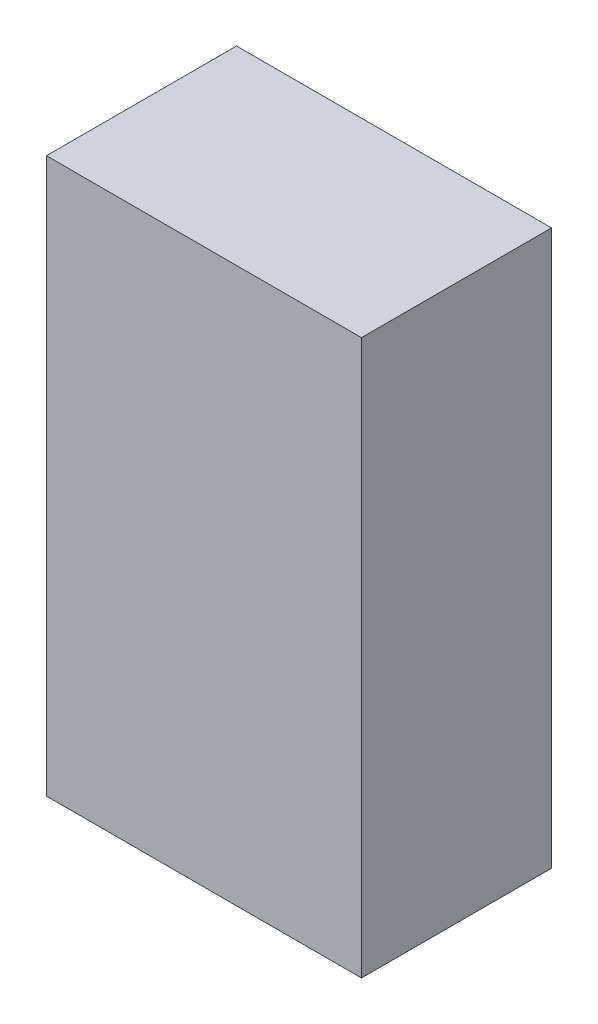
ISO-10303-21;
HEADER;
FILE_DESCRIPTION(('STEP AP214'),'2;1');
FILE_NAME('part.step','',(''),(''),'','','');
FILE_SCHEMA(('AUTOMOTIVE_DESIGN { 1 0 10303 214 1 1 1 1 }'));
ENDSEC;
DATA;
#1=APPLICATION_CONTEXT('core data for automotive mechanical design processes');
#2=APPLICATION_PROTOCOL_DEFINITION('international standard','automotive_design',2000,#1);
#3=PRODUCT_CONTEXT('',#1,'mechanical');
#4=PRODUCT('Part','Part','',(#3));
#5=PRODUCT_RELATED_PRODUCT_CATEGORY('part','',(#4));
#6=PRODUCT_DEFINITION_FORMATION('','',#4);
#7=PRODUCT_DEFINITION_CONTEXT('part definition',#1,'design');
#8=PRODUCT_DEFINITION('design','',#6,#7);
#9=PRODUCT_DEFINITION_SHAPE('','',#8);
#10=(LENGTH_UNIT() NAMED_UNIT(*) SI_UNIT(.MILLI.,.METRE.));
#11=(NAMED_UNIT(*) PLANE_ANGLE_UNIT() SI_UNIT($,.RADIAN.));
#12=(NAMED_UNIT(*) SI_UNIT($,.STERADIAN.) SOLID_ANGLE_UNIT());
#13=UNCERTAINTY_MEASURE_WITH_UNIT(LENGTH_MEASURE(1.E-05),#10,'distance_accuracy_value','');
#14=(GEOMETRIC_REPRESENTATION_CONTEXT(3) GLOBAL_UNCERTAINTY_ASSIGNED_CONTEXT((#13)) GLOBAL_UNIT_ASSIGNED_CONTEXT((#10,
#11,#12)) REPRESENTATION_CONTEXT('',''));
#15=CARTESIAN_POINT('',(0.,0.,0.));
#16=DIRECTION('',(0.,0.,1.));
#17=DIRECTION('',(1.,0.,0.));
#18=AXIS2_PLACEMENT_3D('',#15,#16,#17);
#19=CARTESIAN_POINT('',(-15.367,-27.051,18.542));
#20=DIRECTION('',(1.,0.,0.));
#21=DIRECTION('',(0.,0.,-1.));
#22=AXIS2_PLACEMENT_3D('',#19,#20,#21);
#23=PLANE('',#22);
#24=DIRECTION('',(0.,-1.,0.));
#25=VECTOR('',#24,1.);
#26=CARTESIAN_POINT('',(-15.367,-27.051,0.));
#27=LINE('',#26,#25);
#28=CARTESIAN_POINT('',(-15.367,27.051,0.));
#29=VERTEX_POINT('',#28);
#30=CARTESIAN_POINT('',(-15.367,-27.051,0.));
#31=VERTEX_POINT('',#30);
#32=EDGE_CURVE('E107',#29,#31,#27,.T.);
#33=ORIENTED_EDGE('',*,*,#32,.T.);
#34=DIRECTION('',(0.,0.,-1.));
#35=VECTOR('',#34,1.);
#36=CARTESIAN_POINT('',(-15.367,-27.051,18.542));
#37=LINE('',#36,#35);
#38=CARTESIAN_POINT('',(-15.367,-27.051,18.542));
#39=VERTEX_POINT('',#38);
#40=EDGE_CURVE('E11',#39,#31,#37,.T.);
#41=ORIENTED_EDGE('',*,*,#40,.F.);
#42=DIRECTION('',(0.,-1.,0.));
#43=VECTOR('',#42,1.);
#44=CARTESIAN_POINT('',(-15.367,-27.051,18.542));
#45=LINE('',#44,#43);
#46=CARTESIAN_POINT('',(-15.367,27.051,18.542));
#47=VERTEX_POINT('',#46);
#48=EDGE_CURVE('E91',#47,#39,#45,.T.);
#49=ORIENTED_EDGE('',*,*,#48,.F.);
#50=DIRECTION('',(0.,0.,-1.));
#51=VECTOR('',#50,1.);
#52=CARTESIAN_POINT('',(-15.367,27.051,18.542));
#53=LINE('',#52,#51);
#54=EDGE_CURVE('E103',#47,#29,#53,.T.);
#55=ORIENTED_EDGE('',*,*,#54,.T.);
#56=EDGE_LOOP('',(#33,#41,#49,#55));
#57=FACE_BOUND('',#56,.T.);
#58=ADVANCED_FACE('F38',(#57),#23,.F.);
#59=CARTESIAN_POINT('',(-15.367,-27.051,18.542));
#60=DIRECTION('',(0.,1.,0.));
#61=DIRECTION('',(0.,0.,1.));
#62=AXIS2_PLACEMENT_3D('',#59,#60,#61);
#63=PLANE('',#62);
#64=DIRECTION('',(1.,0.,0.));
#65=VECTOR('',#64,1.);
#66=CARTESIAN_POINT('',(-15.367,-27.051,0.));
#67=LINE('',#66,#65);
#68=CARTESIAN_POINT('',(15.367,-27.051,0.));
#69=VERTEX_POINT('',#68);
#70=EDGE_CURVE('E95',#31,#69,#67,.T.);
#71=ORIENTED_EDGE('',*,*,#70,.T.);
#72=DIRECTION('',(0.,0.,-1.));
#73=VECTOR('',#72,1.);
#74=CARTESIAN_POINT('',(15.367,-27.051,18.542));
#75=LINE('',#74,#73);
#76=CARTESIAN_POINT('',(15.367,-27.051,18.542));
#77=VERTEX_POINT('',#76);
#78=EDGE_CURVE('E46',#77,#69,#75,.T.);
#79=ORIENTED_EDGE('',*,*,#78,.F.);
#80=DIRECTION('',(1.,0.,0.));
#81=VECTOR('',#80,1.);
#82=CARTESIAN_POINT('',(-15.367,-27.051,18.542));
#83=LINE('',#82,#81);
#84=EDGE_CURVE('E86',#39,#77,#83,.T.);
#85=ORIENTED_EDGE('',*,*,#84,.F.);
#86=ORIENTED_EDGE('',*,*,#40,.T.);
#87=EDGE_LOOP('',(#71,#79,#85,#86));
#88=FACE_BOUND('',#87,.T.);
#89=ADVANCED_FACE('F94',(#88),#63,.F.);
#90=CARTESIAN_POINT('',(15.367,-27.051,18.542));
#91=DIRECTION('',(-1.,0.,0.));
#92=DIRECTION('',(0.,0.,1.));
#93=AXIS2_PLACEMENT_3D('',#90,#91,#92);
#94=PLANE('',#93);
#95=DIRECTION('',(0.,1.,0.));
#96=VECTOR('',#95,1.);
#97=CARTESIAN_POINT('',(15.367,-27.051,0.));
#98=LINE('',#97,#96);
#99=CARTESIAN_POINT('',(15.367,27.051,0.));
#100=VERTEX_POINT('',#99);
#101=EDGE_CURVE('E73',#69,#100,#98,.T.);
#102=ORIENTED_EDGE('',*,*,#101,.T.);
#103=DIRECTION('',(0.,0.,-1.));
#104=VECTOR('',#103,1.);
#105=CARTESIAN_POINT('',(15.367,27.051,18.542));
#106=LINE('',#105,#104);
#107=CARTESIAN_POINT('',(15.367,27.051,18.542));
#108=VERTEX_POINT('',#107);
#109=EDGE_CURVE('E96',#108,#100,#106,.T.);
#110=ORIENTED_EDGE('',*,*,#109,.F.);
#111=DIRECTION('',(0.,1.,0.));
#112=VECTOR('',#111,1.);
#113=CARTESIAN_POINT('',(15.367,-27.051,18.542));
#114=LINE('',#113,#112);
#115=EDGE_CURVE('E89',#77,#108,#114,.T.);
#116=ORIENTED_EDGE('',*,*,#115,.F.);
#117=ORIENTED_EDGE('',*,*,#78,.T.);
#118=EDGE_LOOP('',(#102,#110,#116,#117));
#119=FACE_BOUND('',#118,.T.);
#120=ADVANCED_FACE('F97',(#119),#94,.F.);
#121=CARTESIAN_POINT('',(-15.367,27.051,18.542));
#122=DIRECTION('',(0.,-1.,0.));
#123=DIRECTION('',(0.,0.,-1.));
#124=AXIS2_PLACEMENT_3D('',#121,#122,#123);
#125=PLANE('',#124);
#126=DIRECTION('',(-1.,0.,0.));
#127=VECTOR('',#126,1.);
#128=CARTESIAN_POINT('',(-15.367,27.051,0.));
#129=LINE('',#128,#127);
#130=EDGE_CURVE('E79',#100,#29,#129,.T.);
#131=ORIENTED_EDGE('',*,*,#130,.T.);
#132=ORIENTED_EDGE('',*,*,#54,.F.);
#133=DIRECTION('',(-1.,0.,0.));
#134=VECTOR('',#133,1.);
#135=CARTESIAN_POINT('',(-15.367,27.051,18.542));
#136=LINE('',#135,#134);
#137=EDGE_CURVE('E56',#108,#47,#136,.T.);
#138=ORIENTED_EDGE('',*,*,#137,.F.);
#139=ORIENTED_EDGE('',*,*,#109,.T.);
#140=EDGE_LOOP('',(#131,#132,#138,#139));
#141=FACE_BOUND('',#140,.T.);
#142=ADVANCED_FACE('F116',(#141),#125,.F.);
#143=CARTESIAN_POINT('',(0.,0.,18.542));
#144=DIRECTION('',(0.,0.,-1.));
#145=DIRECTION('',(-1.,0.,0.));
#146=AXIS2_PLACEMENT_3D('',#143,#144,#145);
#147=PLANE('',#146);
#148=ORIENTED_EDGE('',*,*,#48,.T.);
#149=ORIENTED_EDGE('',*,*,#84,.T.);
#150=ORIENTED_EDGE('',*,*,#115,.T.);
#151=ORIENTED_EDGE('',*,*,#137,.T.);
#152=EDGE_LOOP('',(#148,#149,#150,#151));
#153=FACE_BOUND('',#152,.T.);
#154=ADVANCED_FACE('F87',(#153),#147,.F.);
#155=CARTESIAN_POINT('',(0.,0.,0.));
#156=DIRECTION('',(0.,0.,-1.));
#157=DIRECTION('',(-1.,0.,0.));
#158=AXIS2_PLACEMENT_3D('',#155,#156,#157);
#159=PLANE('',#158);
#160=ORIENTED_EDGE('',*,*,#32,.F.);
#161=ORIENTED_EDGE('',*,*,#130,.F.);
#162=ORIENTED_EDGE('',*,*,#101,.F.);
#163=ORIENTED_EDGE('',*,*,#70,.F.);
#164=EDGE_LOOP('',(#160,#161,#162,#163));
#165=FACE_BOUND('',#164,.T.);
#166=ADVANCED_FACE('F119',(#165),#159,.T.);
#167=CLOSED_SHELL('',(#58,#89,#120,#142,#154,#166));
#168=MANIFOLD_SOLID_BREP('B2',#167);
#169=ADVANCED_BREP_SHAPE_REPRESENTATION('',(#18,#168),#14);
#170=SHAPE_DEFINITION_REPRESENTATION(#9,#169);
ENDSEC;
END-ISO-10303-21;
